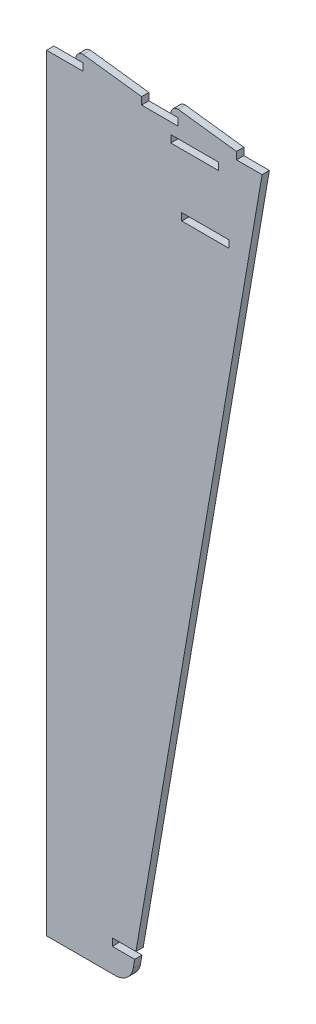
ISO-10303-21;
HEADER;
FILE_DESCRIPTION(('STEP AP214'),'2;1');
FILE_NAME('part.step','',(''),(''),'','','');
FILE_SCHEMA(('AUTOMOTIVE_DESIGN { 1 0 10303 214 1 1 1 1 }'));
ENDSEC;
DATA;
#1=APPLICATION_CONTEXT('core data for automotive mechanical design processes');
#2=APPLICATION_PROTOCOL_DEFINITION('international standard','automotive_design',2000,#1);
#3=PRODUCT_CONTEXT('',#1,'mechanical');
#4=PRODUCT('Part','Part','',(#3));
#5=PRODUCT_RELATED_PRODUCT_CATEGORY('part','',(#4));
#6=PRODUCT_DEFINITION_FORMATION('','',#4);
#7=PRODUCT_DEFINITION_CONTEXT('part definition',#1,'design');
#8=PRODUCT_DEFINITION('design','',#6,#7);
#9=PRODUCT_DEFINITION_SHAPE('','',#8);
#10=(LENGTH_UNIT() NAMED_UNIT(*) SI_UNIT(.MILLI.,.METRE.));
#11=(NAMED_UNIT(*) PLANE_ANGLE_UNIT() SI_UNIT($,.RADIAN.));
#12=(NAMED_UNIT(*) SI_UNIT($,.STERADIAN.) SOLID_ANGLE_UNIT());
#13=UNCERTAINTY_MEASURE_WITH_UNIT(LENGTH_MEASURE(1.E-05),#10,'distance_accuracy_value','');
#14=(GEOMETRIC_REPRESENTATION_CONTEXT(3) GLOBAL_UNCERTAINTY_ASSIGNED_CONTEXT((#13)) GLOBAL_UNIT_ASSIGNED_CONTEXT((#10,
#11,#12)) REPRESENTATION_CONTEXT('',''));
#15=CARTESIAN_POINT('',(0.,0.,0.));
#16=DIRECTION('',(0.,0.,1.));
#17=DIRECTION('',(1.,0.,0.));
#18=AXIS2_PLACEMENT_3D('',#15,#16,#17);
#19=CARTESIAN_POINT('',(2.49999999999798,-16.2500000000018,2.));
#20=DIRECTION('',(0.,0.,1.));
#21=DIRECTION('',(1.,0.,0.));
#22=AXIS2_PLACEMENT_3D('',#19,#20,#21);
#23=PLANE('',#22);
#24=DIRECTION('',(0.,-1.,0.));
#25=VECTOR('',#24,1.);
#26=CARTESIAN_POINT('',(-33.5000000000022,-18.2500000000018,2.));
#27=LINE('',#26,#25);
#28=CARTESIAN_POINT('',(-33.5000000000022,-18.2500000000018,2.));
#29=VERTEX_POINT('',#28);
#30=CARTESIAN_POINT('',(-33.5000000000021,-228.250000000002,2.));
#31=VERTEX_POINT('',#30);
#32=EDGE_CURVE('E335',#29,#31,#27,.T.);
#33=ORIENTED_EDGE('',*,*,#32,.T.);
#34=DIRECTION('',(1.,0.,0.));
#35=VECTOR('',#34,1.);
#36=CARTESIAN_POINT('',(-33.5000000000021,-228.250000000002,2.));
#37=LINE('',#36,#35);
#38=CARTESIAN_POINT('',(-14.7157945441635,-228.250000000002,2.));
#39=VERTEX_POINT('',#38);
#40=EDGE_CURVE('E337',#31,#39,#37,.T.);
#41=ORIENTED_EDGE('',*,*,#40,.T.);
#42=CARTESIAN_POINT('',(-14.7157945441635,-223.250000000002,2.));
#43=DIRECTION('',(0.,0.,1.));
#44=DIRECTION('',(1.,0.,0.));
#45=AXIS2_PLACEMENT_3D('',#42,#43,#44);
#46=CIRCLE('',#45,5.);
#47=CARTESIAN_POINT('',(-9.78768327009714,-224.094819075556,2.));
#48=VERTEX_POINT('',#47);
#49=EDGE_CURVE('E426',#39,#48,#46,.T.);
#50=ORIENTED_EDGE('',*,*,#49,.T.);
#51=DIRECTION('',(0.168963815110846,0.985622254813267,0.));
#52=VECTOR('',#51,1.);
#53=CARTESIAN_POINT('',(-10.5000000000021,-228.250000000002,2.));
#54=LINE('',#53,#52);
#55=CARTESIAN_POINT('',(-9.38228167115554,-221.729976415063,2.));
#56=VERTEX_POINT('',#55);
#57=EDGE_CURVE('E305',#48,#56,#54,.T.);
#58=ORIENTED_EDGE('',*,*,#57,.T.);
#59=DIRECTION('',(-1.,0.,0.));
#60=VECTOR('',#59,1.);
#61=CARTESIAN_POINT('',(2.49999999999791,-221.729976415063,2.));
#62=LINE('',#61,#60);
#63=CARTESIAN_POINT('',(-15.5000000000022,-221.729976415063,2.00000000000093));
#64=VERTEX_POINT('',#63);
#65=EDGE_CURVE('E301',#56,#64,#62,.T.);
#66=ORIENTED_EDGE('',*,*,#65,.T.);
#67=DIRECTION('',(0.,1.,0.));
#68=VECTOR('',#67,1.);
#69=CARTESIAN_POINT('',(-15.5000000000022,-219.729976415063,2.00000000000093));
#70=LINE('',#69,#68);
#71=CARTESIAN_POINT('',(-15.5000000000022,-219.729976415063,2.00000000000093));
#72=VERTEX_POINT('',#71);
#73=EDGE_CURVE('E288',#64,#72,#70,.T.);
#74=ORIENTED_EDGE('',*,*,#73,.T.);
#75=DIRECTION('',(-1.,0.,0.));
#76=VECTOR('',#75,1.);
#77=CARTESIAN_POINT('',(2.49999999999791,-219.729976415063,2.));
#78=LINE('',#77,#76);
#79=CARTESIAN_POINT('',(-9.0394245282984,-219.729976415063,2.));
#80=VERTEX_POINT('',#79);
#81=EDGE_CURVE('E297',#80,#72,#78,.T.);
#82=ORIENTED_EDGE('',*,*,#81,.F.);
#83=CARTESIAN_POINT('',(25.499999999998,-18.2500000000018,2.));
#84=VERTEX_POINT('',#83);
#85=EDGE_CURVE('E309',#80,#84,#54,.T.);
#86=ORIENTED_EDGE('',*,*,#85,.T.);
#87=DIRECTION('',(-1.,0.,0.));
#88=VECTOR('',#87,1.);
#89=CARTESIAN_POINT('',(18.499999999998,-18.2500000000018,2.));
#90=LINE('',#89,#88);
#91=CARTESIAN_POINT('',(18.499999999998,-18.2500000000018,2.));
#92=VERTEX_POINT('',#91);
#93=EDGE_CURVE('E308',#84,#92,#90,.T.);
#94=ORIENTED_EDGE('',*,*,#93,.T.);
#95=DIRECTION('',(0.,1.,0.));
#96=VECTOR('',#95,1.);
#97=CARTESIAN_POINT('',(18.499999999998,-18.2500000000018,2.));
#98=LINE('',#97,#96);
#99=CARTESIAN_POINT('',(18.499999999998,-16.2500000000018,2.));
#100=VERTEX_POINT('',#99);
#101=EDGE_CURVE('E311',#92,#100,#98,.T.);
#102=ORIENTED_EDGE('',*,*,#101,.T.);
#103=DIRECTION('',(-0.992277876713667,0.124034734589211,0.));
#104=VECTOR('',#103,1.);
#105=CARTESIAN_POINT('',(2.49999999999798,-14.2500000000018,2.));
#106=LINE('',#105,#104);
#107=CARTESIAN_POINT('',(2.49999999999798,-14.2500000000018,2.));
#108=VERTEX_POINT('',#107);
#109=EDGE_CURVE('E313',#100,#108,#106,.T.);
#110=ORIENTED_EDGE('',*,*,#109,.T.);
#111=CARTESIAN_POINT('',(2.49999999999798,-16.2500000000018,2.));
#112=DIRECTION('',(0.,0.,1.));
#113=DIRECTION('',(1.,0.,0.));
#114=AXIS2_PLACEMENT_3D('',#111,#112,#113);
#115=CIRCLE('',#114,2.);
#116=CARTESIAN_POINT('',(0.499999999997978,-16.2500000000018,2.));
#117=VERTEX_POINT('',#116);
#118=EDGE_CURVE('E315',#108,#117,#115,.T.);
#119=ORIENTED_EDGE('',*,*,#118,.T.);
#120=DIRECTION('',(1.,0.,0.));
#121=VECTOR('',#120,1.);
#122=CARTESIAN_POINT('',(2.49999999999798,-16.2500000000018,2.));
#123=LINE('',#122,#121);
#124=CARTESIAN_POINT('',(2.49999999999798,-16.2500000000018,2.));
#125=VERTEX_POINT('',#124);
#126=EDGE_CURVE('E317',#117,#125,#123,.T.);
#127=ORIENTED_EDGE('',*,*,#126,.T.);
#128=DIRECTION('',(0.,-1.,0.));
#129=VECTOR('',#128,1.);
#130=CARTESIAN_POINT('',(2.49999999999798,-18.2500000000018,2.));
#131=LINE('',#130,#129);
#132=CARTESIAN_POINT('',(2.49999999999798,-18.2500000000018,2.));
#133=VERTEX_POINT('',#132);
#134=EDGE_CURVE('E319',#125,#133,#131,.T.);
#135=ORIENTED_EDGE('',*,*,#134,.T.);
#136=DIRECTION('',(-1.,0.,0.));
#137=VECTOR('',#136,1.);
#138=CARTESIAN_POINT('',(2.49999999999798,-18.2500000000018,2.));
#139=LINE('',#138,#137);
#140=CARTESIAN_POINT('',(-7.50000000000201,-18.2500000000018,2.));
#141=VERTEX_POINT('',#140);
#142=EDGE_CURVE('E321',#133,#141,#139,.T.);
#143=ORIENTED_EDGE('',*,*,#142,.T.);
#144=DIRECTION('',(0.,1.,0.));
#145=VECTOR('',#144,1.);
#146=CARTESIAN_POINT('',(-7.50000000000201,-18.2500000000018,2.));
#147=LINE('',#146,#145);
#148=CARTESIAN_POINT('',(-7.50000000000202,-16.2500000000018,2.));
#149=VERTEX_POINT('',#148);
#150=EDGE_CURVE('E323',#141,#149,#147,.T.);
#151=ORIENTED_EDGE('',*,*,#150,.T.);
#152=DIRECTION('',(-0.992277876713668,0.124034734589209,0.));
#153=VECTOR('',#152,1.);
#154=CARTESIAN_POINT('',(-23.500000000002,-14.2500000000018,2.));
#155=LINE('',#154,#153);
#156=CARTESIAN_POINT('',(-23.500000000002,-14.2500000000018,2.));
#157=VERTEX_POINT('',#156);
#158=EDGE_CURVE('E325',#149,#157,#155,.T.);
#159=ORIENTED_EDGE('',*,*,#158,.T.);
#160=CARTESIAN_POINT('',(-23.500000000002,-16.2500000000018,2.));
#161=DIRECTION('',(0.,0.,1.));
#162=DIRECTION('',(1.,0.,0.));
#163=AXIS2_PLACEMENT_3D('',#160,#161,#162);
#164=CIRCLE('',#163,2.);
#165=CARTESIAN_POINT('',(-25.500000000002,-16.2500000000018,2.));
#166=VERTEX_POINT('',#165);
#167=EDGE_CURVE('E327',#157,#166,#164,.T.);
#168=ORIENTED_EDGE('',*,*,#167,.T.);
#169=DIRECTION('',(1.,0.,0.));
#170=VECTOR('',#169,1.);
#171=CARTESIAN_POINT('',(-23.500000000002,-16.2500000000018,2.));
#172=LINE('',#171,#170);
#173=CARTESIAN_POINT('',(-23.500000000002,-16.2500000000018,2.));
#174=VERTEX_POINT('',#173);
#175=EDGE_CURVE('E329',#166,#174,#172,.T.);
#176=ORIENTED_EDGE('',*,*,#175,.T.);
#177=DIRECTION('',(0.,-1.,0.));
#178=VECTOR('',#177,1.);
#179=CARTESIAN_POINT('',(-23.500000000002,-18.2500000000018,2.));
#180=LINE('',#179,#178);
#181=CARTESIAN_POINT('',(-23.500000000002,-18.2500000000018,2.));
#182=VERTEX_POINT('',#181);
#183=EDGE_CURVE('E331',#174,#182,#180,.T.);
#184=ORIENTED_EDGE('',*,*,#183,.T.);
#185=DIRECTION('',(-1.,0.,0.));
#186=VECTOR('',#185,1.);
#187=CARTESIAN_POINT('',(-23.500000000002,-18.2500000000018,2.));
#188=LINE('',#187,#186);
#189=EDGE_CURVE('E333',#182,#29,#188,.T.);
#190=ORIENTED_EDGE('',*,*,#189,.T.);
#191=EDGE_LOOP('',(#33,#41,#50,#58,#66,#74,#82,#86,#94,#102,#110,#119,#127,#135,#143,#151,#159,
#168,#176,#184,#190));
#192=FACE_BOUND('',#191,.T.);
#193=DIRECTION('',(-1.,0.,0.));
#194=VECTOR('',#193,1.);
#195=CARTESIAN_POINT('',(13.4999999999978,-21.2500000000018,2.));
#196=LINE('',#195,#194);
#197=CARTESIAN_POINT('',(13.4999999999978,-21.2500000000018,2.));
#198=VERTEX_POINT('',#197);
#199=CARTESIAN_POINT('',(0.499999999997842,-21.2500000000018,2.));
#200=VERTEX_POINT('',#199);
#201=EDGE_CURVE('E263',#198,#200,#196,.T.);
#202=ORIENTED_EDGE('',*,*,#201,.F.);
#203=DIRECTION('',(0.,1.,0.));
#204=VECTOR('',#203,1.);
#205=CARTESIAN_POINT('',(13.4999999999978,-23.2500000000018,2.));
#206=LINE('',#205,#204);
#207=CARTESIAN_POINT('',(13.4999999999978,-23.2500000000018,2.));
#208=VERTEX_POINT('',#207);
#209=EDGE_CURVE('E261',#208,#198,#206,.T.);
#210=ORIENTED_EDGE('',*,*,#209,.F.);
#211=DIRECTION('',(1.,0.,0.));
#212=VECTOR('',#211,1.);
#213=CARTESIAN_POINT('',(13.4999999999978,-23.2500000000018,2.));
#214=LINE('',#213,#212);
#215=CARTESIAN_POINT('',(0.499999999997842,-23.2500000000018,2.));
#216=VERTEX_POINT('',#215);
#217=EDGE_CURVE('E268',#216,#208,#214,.T.);
#218=ORIENTED_EDGE('',*,*,#217,.F.);
#219=DIRECTION('',(0.,-1.,0.));
#220=VECTOR('',#219,1.);
#221=CARTESIAN_POINT('',(0.499999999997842,-23.2500000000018,2.));
#222=LINE('',#221,#220);
#223=EDGE_CURVE('E266',#200,#216,#222,.T.);
#224=ORIENTED_EDGE('',*,*,#223,.F.);
#225=EDGE_LOOP('',(#202,#210,#218,#224));
#226=FACE_BOUND('',#225,.T.);
#227=DIRECTION('',(1.,0.,0.));
#228=VECTOR('',#227,1.);
#229=CARTESIAN_POINT('',(3.49999999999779,-40.2500000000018,2.00000000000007));
#230=LINE('',#229,#228);
#231=CARTESIAN_POINT('',(3.49999999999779,-40.2500000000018,2.00000000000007));
#232=VERTEX_POINT('',#231);
#233=CARTESIAN_POINT('',(16.4999999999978,-40.2500000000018,2.));
#234=VERTEX_POINT('',#233);
#235=EDGE_CURVE('E237',#232,#234,#230,.T.);
#236=ORIENTED_EDGE('',*,*,#235,.F.);
#237=DIRECTION('',(0.,-1.,0.));
#238=VECTOR('',#237,1.);
#239=CARTESIAN_POINT('',(3.49999999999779,-38.2500000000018,2.00000000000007));
#240=LINE('',#239,#238);
#241=CARTESIAN_POINT('',(3.49999999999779,-38.2500000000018,2.00000000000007));
#242=VERTEX_POINT('',#241);
#243=EDGE_CURVE('E227',#242,#232,#240,.T.);
#244=ORIENTED_EDGE('',*,*,#243,.F.);
#245=DIRECTION('',(-1.,0.,0.));
#246=VECTOR('',#245,1.);
#247=CARTESIAN_POINT('',(3.49999999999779,-38.2500000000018,2.00000000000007));
#248=LINE('',#247,#246);
#249=CARTESIAN_POINT('',(16.4999999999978,-38.2500000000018,2.00000000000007));
#250=VERTEX_POINT('',#249);
#251=EDGE_CURVE('E248',#250,#242,#248,.T.);
#252=ORIENTED_EDGE('',*,*,#251,.F.);
#253=DIRECTION('',(0.,1.,0.));
#254=VECTOR('',#253,1.);
#255=CARTESIAN_POINT('',(16.4999999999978,-38.2500000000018,2.00000000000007));
#256=LINE('',#255,#254);
#257=EDGE_CURVE('E246',#234,#250,#256,.T.);
#258=ORIENTED_EDGE('',*,*,#257,.F.);
#259=EDGE_LOOP('',(#236,#244,#252,#258));
#260=FACE_BOUND('',#259,.T.);
#261=ADVANCED_FACE('F35',(#192,#226,#260),#23,.T.);
#262=CARTESIAN_POINT('',(-10.5000000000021,-228.250000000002,2.));
#263=DIRECTION('',(-0.985622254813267,0.168963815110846,0.));
#264=DIRECTION('',(-0.168963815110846,-0.985622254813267,0.));
#265=AXIS2_PLACEMENT_3D('',#262,#263,#264);
#266=PLANE('',#265);
#267=DIRECTION('',(0.,0.,-1.));
#268=VECTOR('',#267,1.);
#269=CARTESIAN_POINT('',(-9.38228167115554,-221.729976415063,2.));
#270=LINE('',#269,#268);
#271=CARTESIAN_POINT('',(-9.38228167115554,-221.729976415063,0.));
#272=VERTEX_POINT('',#271);
#273=EDGE_CURVE('E299',#56,#272,#270,.T.);
#274=ORIENTED_EDGE('',*,*,#273,.F.);
#275=ORIENTED_EDGE('',*,*,#57,.F.);
#276=DIRECTION('',(0.,0.,-1.));
#277=VECTOR('',#276,1.);
#278=CARTESIAN_POINT('',(-9.78768327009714,-224.094819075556,2.));
#279=LINE('',#278,#277);
#280=CARTESIAN_POINT('',(-9.78768327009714,-224.094819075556,0.));
#281=VERTEX_POINT('',#280);
#282=EDGE_CURVE('E419',#48,#281,#279,.T.);
#283=ORIENTED_EDGE('',*,*,#282,.T.);
#284=DIRECTION('',(0.168963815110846,0.985622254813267,0.));
#285=VECTOR('',#284,1.);
#286=CARTESIAN_POINT('',(-10.5000000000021,-228.250000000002,0.));
#287=LINE('',#286,#285);
#288=EDGE_CURVE('E341',#281,#272,#287,.T.);
#289=ORIENTED_EDGE('',*,*,#288,.T.);
#290=EDGE_LOOP('',(#274,#275,#283,#289));
#291=FACE_BOUND('',#290,.T.);
#292=ADVANCED_FACE('F468',(#291),#266,.F.);
#293=ORIENTED_EDGE('',*,*,#85,.F.);
#294=DIRECTION('',(0.,0.,-1.));
#295=VECTOR('',#294,1.);
#296=CARTESIAN_POINT('',(-9.0394245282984,-219.729976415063,2.));
#297=LINE('',#296,#295);
#298=CARTESIAN_POINT('',(-9.0394245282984,-219.729976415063,0.));
#299=VERTEX_POINT('',#298);
#300=EDGE_CURVE('E294',#80,#299,#297,.T.);
#301=ORIENTED_EDGE('',*,*,#300,.T.);
#302=CARTESIAN_POINT('',(25.499999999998,-18.2500000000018,0.));
#303=VERTEX_POINT('',#302);
#304=EDGE_CURVE('E304',#299,#303,#287,.T.);
#305=ORIENTED_EDGE('',*,*,#304,.T.);
#306=DIRECTION('',(0.,0.,-1.));
#307=VECTOR('',#306,1.);
#308=CARTESIAN_POINT('',(25.499999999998,-18.2500000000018,2.));
#309=LINE('',#308,#307);
#310=EDGE_CURVE('E416',#84,#303,#309,.T.);
#311=ORIENTED_EDGE('',*,*,#310,.F.);
#312=EDGE_LOOP('',(#293,#301,#305,#311));
#313=FACE_BOUND('',#312,.T.);
#314=ADVANCED_FACE('F474',(#313),#266,.F.);
#315=CARTESIAN_POINT('',(18.499999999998,-18.2500000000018,2.));
#316=DIRECTION('',(0.,-1.,0.));
#317=DIRECTION('',(0.,0.,-1.));
#318=AXIS2_PLACEMENT_3D('',#315,#316,#317);
#319=PLANE('',#318);
#320=DIRECTION('',(-1.,0.,0.));
#321=VECTOR('',#320,1.);
#322=CARTESIAN_POINT('',(18.499999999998,-18.2500000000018,0.));
#323=LINE('',#322,#321);
#324=CARTESIAN_POINT('',(18.499999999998,-18.2500000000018,0.));
#325=VERTEX_POINT('',#324);
#326=EDGE_CURVE('E344',#303,#325,#323,.T.);
#327=ORIENTED_EDGE('',*,*,#326,.T.);
#328=DIRECTION('',(0.,0.,-1.));
#329=VECTOR('',#328,1.);
#330=CARTESIAN_POINT('',(18.499999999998,-18.2500000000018,2.));
#331=LINE('',#330,#329);
#332=EDGE_CURVE('E413',#92,#325,#331,.T.);
#333=ORIENTED_EDGE('',*,*,#332,.F.);
#334=ORIENTED_EDGE('',*,*,#93,.F.);
#335=ORIENTED_EDGE('',*,*,#310,.T.);
#336=EDGE_LOOP('',(#327,#333,#334,#335));
#337=FACE_BOUND('',#336,.T.);
#338=ADVANCED_FACE('F538',(#337),#319,.F.);
#339=CARTESIAN_POINT('',(18.499999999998,-18.2500000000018,2.));
#340=DIRECTION('',(-1.,0.,0.));
#341=DIRECTION('',(0.,0.,1.));
#342=AXIS2_PLACEMENT_3D('',#339,#340,#341);
#343=PLANE('',#342);
#344=DIRECTION('',(0.,1.,0.));
#345=VECTOR('',#344,1.);
#346=CARTESIAN_POINT('',(18.499999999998,-18.2500000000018,0.));
#347=LINE('',#346,#345);
#348=CARTESIAN_POINT('',(18.499999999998,-16.2500000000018,0.));
#349=VERTEX_POINT('',#348);
#350=EDGE_CURVE('E346',#325,#349,#347,.T.);
#351=ORIENTED_EDGE('',*,*,#350,.T.);
#352=DIRECTION('',(0.,0.,-1.));
#353=VECTOR('',#352,1.);
#354=CARTESIAN_POINT('',(18.499999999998,-16.2500000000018,2.));
#355=LINE('',#354,#353);
#356=EDGE_CURVE('E410',#100,#349,#355,.T.);
#357=ORIENTED_EDGE('',*,*,#356,.F.);
#358=ORIENTED_EDGE('',*,*,#101,.F.);
#359=ORIENTED_EDGE('',*,*,#332,.T.);
#360=EDGE_LOOP('',(#351,#357,#358,#359));
#361=FACE_BOUND('',#360,.T.);
#362=ADVANCED_FACE('F534',(#361),#343,.F.);
#363=CARTESIAN_POINT('',(2.49999999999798,-14.2500000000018,2.));
#364=DIRECTION('',(-0.124034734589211,-0.992277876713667,0.));
#365=DIRECTION('',(0.992277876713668,-0.124034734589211,0.));
#366=AXIS2_PLACEMENT_3D('',#363,#364,#365);
#367=PLANE('',#366);
#368=DIRECTION('',(-0.992277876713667,0.124034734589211,0.));
#369=VECTOR('',#368,1.);
#370=CARTESIAN_POINT('',(2.49999999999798,-14.2500000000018,0.));
#371=LINE('',#370,#369);
#372=CARTESIAN_POINT('',(2.49999999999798,-14.2500000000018,0.));
#373=VERTEX_POINT('',#372);
#374=EDGE_CURVE('E348',#349,#373,#371,.T.);
#375=ORIENTED_EDGE('',*,*,#374,.T.);
#376=DIRECTION('',(0.,0.,-1.));
#377=VECTOR('',#376,1.);
#378=CARTESIAN_POINT('',(2.49999999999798,-14.2500000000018,2.));
#379=LINE('',#378,#377);
#380=EDGE_CURVE('E407',#108,#373,#379,.T.);
#381=ORIENTED_EDGE('',*,*,#380,.F.);
#382=ORIENTED_EDGE('',*,*,#109,.F.);
#383=ORIENTED_EDGE('',*,*,#356,.T.);
#384=EDGE_LOOP('',(#375,#381,#382,#383));
#385=FACE_BOUND('',#384,.T.);
#386=ADVANCED_FACE('F530',(#385),#367,.F.);
#387=CARTESIAN_POINT('',(2.49999999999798,-16.2500000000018,2.));
#388=DIRECTION('',(0.,0.,-1.));
#389=DIRECTION('',(-1.,0.,0.));
#390=AXIS2_PLACEMENT_3D('',#387,#388,#389);
#391=CYLINDRICAL_SURFACE('',#390,2.);
#392=CARTESIAN_POINT('',(2.49999999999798,-16.2500000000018,0.));
#393=DIRECTION('',(0.,0.,1.));
#394=DIRECTION('',(1.,0.,0.));
#395=AXIS2_PLACEMENT_3D('',#392,#393,#394);
#396=CIRCLE('',#395,2.);
#397=CARTESIAN_POINT('',(0.499999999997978,-16.2500000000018,0.));
#398=VERTEX_POINT('',#397);
#399=EDGE_CURVE('E350',#373,#398,#396,.T.);
#400=ORIENTED_EDGE('',*,*,#399,.T.);
#401=DIRECTION('',(0.,0.,-1.));
#402=VECTOR('',#401,1.);
#403=CARTESIAN_POINT('',(0.499999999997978,-16.2500000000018,2.));
#404=LINE('',#403,#402);
#405=EDGE_CURVE('E404',#117,#398,#404,.T.);
#406=ORIENTED_EDGE('',*,*,#405,.F.);
#407=ORIENTED_EDGE('',*,*,#118,.F.);
#408=ORIENTED_EDGE('',*,*,#380,.T.);
#409=EDGE_LOOP('',(#400,#406,#407,#408));
#410=FACE_BOUND('',#409,.T.);
#411=ADVANCED_FACE('F526',(#410),#391,.T.);
#412=CARTESIAN_POINT('',(2.49999999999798,-16.2500000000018,2.));
#413=DIRECTION('',(0.,1.,0.));
#414=DIRECTION('',(-1.,0.,0.));
#415=AXIS2_PLACEMENT_3D('',#412,#413,#414);
#416=PLANE('',#415);
#417=DIRECTION('',(1.,0.,0.));
#418=VECTOR('',#417,1.);
#419=CARTESIAN_POINT('',(2.49999999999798,-16.2500000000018,0.));
#420=LINE('',#419,#418);
#421=CARTESIAN_POINT('',(2.49999999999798,-16.2500000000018,0.));
#422=VERTEX_POINT('',#421);
#423=EDGE_CURVE('E352',#398,#422,#420,.T.);
#424=ORIENTED_EDGE('',*,*,#423,.T.);
#425=DIRECTION('',(0.,0.,-1.));
#426=VECTOR('',#425,1.);
#427=CARTESIAN_POINT('',(2.49999999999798,-16.2500000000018,2.));
#428=LINE('',#427,#426);
#429=EDGE_CURVE('E401',#125,#422,#428,.T.);
#430=ORIENTED_EDGE('',*,*,#429,.F.);
#431=ORIENTED_EDGE('',*,*,#126,.F.);
#432=ORIENTED_EDGE('',*,*,#405,.T.);
#433=EDGE_LOOP('',(#424,#430,#431,#432));
#434=FACE_BOUND('',#433,.T.);
#435=ADVANCED_FACE('F522',(#434),#416,.F.);
#436=CARTESIAN_POINT('',(2.49999999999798,-18.2500000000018,2.));
#437=DIRECTION('',(1.,0.,0.));
#438=DIRECTION('',(0.,1.,0.));
#439=AXIS2_PLACEMENT_3D('',#436,#437,#438);
#440=PLANE('',#439);
#441=DIRECTION('',(0.,-1.,0.));
#442=VECTOR('',#441,1.);
#443=CARTESIAN_POINT('',(2.49999999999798,-18.2500000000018,0.));
#444=LINE('',#443,#442);
#445=CARTESIAN_POINT('',(2.49999999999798,-18.2500000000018,0.));
#446=VERTEX_POINT('',#445);
#447=EDGE_CURVE('E354',#422,#446,#444,.T.);
#448=ORIENTED_EDGE('',*,*,#447,.T.);
#449=DIRECTION('',(0.,0.,-1.));
#450=VECTOR('',#449,1.);
#451=CARTESIAN_POINT('',(2.49999999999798,-18.2500000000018,2.));
#452=LINE('',#451,#450);
#453=EDGE_CURVE('E398',#133,#446,#452,.T.);
#454=ORIENTED_EDGE('',*,*,#453,.F.);
#455=ORIENTED_EDGE('',*,*,#134,.F.);
#456=ORIENTED_EDGE('',*,*,#429,.T.);
#457=EDGE_LOOP('',(#448,#454,#455,#456));
#458=FACE_BOUND('',#457,.T.);
#459=ADVANCED_FACE('F518',(#458),#440,.F.);
#460=CARTESIAN_POINT('',(2.49999999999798,-18.2500000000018,2.));
#461=DIRECTION('',(0.,-1.,0.));
#462=DIRECTION('',(0.,0.,-1.));
#463=AXIS2_PLACEMENT_3D('',#460,#461,#462);
#464=PLANE('',#463);
#465=DIRECTION('',(-1.,0.,0.));
#466=VECTOR('',#465,1.);
#467=CARTESIAN_POINT('',(2.49999999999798,-18.2500000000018,0.));
#468=LINE('',#467,#466);
#469=CARTESIAN_POINT('',(-7.50000000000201,-18.2500000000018,0.));
#470=VERTEX_POINT('',#469);
#471=EDGE_CURVE('E356',#446,#470,#468,.T.);
#472=ORIENTED_EDGE('',*,*,#471,.T.);
#473=DIRECTION('',(0.,0.,-1.));
#474=VECTOR('',#473,1.);
#475=CARTESIAN_POINT('',(-7.50000000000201,-18.2500000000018,2.));
#476=LINE('',#475,#474);
#477=EDGE_CURVE('E395',#141,#470,#476,.T.);
#478=ORIENTED_EDGE('',*,*,#477,.F.);
#479=ORIENTED_EDGE('',*,*,#142,.F.);
#480=ORIENTED_EDGE('',*,*,#453,.T.);
#481=EDGE_LOOP('',(#472,#478,#479,#480));
#482=FACE_BOUND('',#481,.T.);
#483=ADVANCED_FACE('F514',(#482),#464,.F.);
#484=CARTESIAN_POINT('',(-7.50000000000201,-18.2500000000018,2.));
#485=DIRECTION('',(-1.,0.,0.));
#486=DIRECTION('',(0.,-1.,0.));
#487=AXIS2_PLACEMENT_3D('',#484,#485,#486);
#488=PLANE('',#487);
#489=DIRECTION('',(0.,1.,0.));
#490=VECTOR('',#489,1.);
#491=CARTESIAN_POINT('',(-7.50000000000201,-18.2500000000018,0.));
#492=LINE('',#491,#490);
#493=CARTESIAN_POINT('',(-7.50000000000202,-16.2500000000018,0.));
#494=VERTEX_POINT('',#493);
#495=EDGE_CURVE('E358',#470,#494,#492,.T.);
#496=ORIENTED_EDGE('',*,*,#495,.T.);
#497=DIRECTION('',(0.,0.,-1.));
#498=VECTOR('',#497,1.);
#499=CARTESIAN_POINT('',(-7.50000000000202,-16.2500000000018,2.));
#500=LINE('',#499,#498);
#501=EDGE_CURVE('E392',#149,#494,#500,.T.);
#502=ORIENTED_EDGE('',*,*,#501,.F.);
#503=ORIENTED_EDGE('',*,*,#150,.F.);
#504=ORIENTED_EDGE('',*,*,#477,.T.);
#505=EDGE_LOOP('',(#496,#502,#503,#504));
#506=FACE_BOUND('',#505,.T.);
#507=ADVANCED_FACE('F510',(#506),#488,.F.);
#508=CARTESIAN_POINT('',(-23.500000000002,-14.2500000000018,2.));
#509=DIRECTION('',(-0.124034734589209,-0.992277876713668,0.));
#510=DIRECTION('',(0.992277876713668,-0.124034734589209,0.));
#511=AXIS2_PLACEMENT_3D('',#508,#509,#510);
#512=PLANE('',#511);
#513=DIRECTION('',(-0.992277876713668,0.124034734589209,0.));
#514=VECTOR('',#513,1.);
#515=CARTESIAN_POINT('',(-23.500000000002,-14.2500000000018,0.));
#516=LINE('',#515,#514);
#517=CARTESIAN_POINT('',(-23.500000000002,-14.2500000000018,0.));
#518=VERTEX_POINT('',#517);
#519=EDGE_CURVE('E360',#494,#518,#516,.T.);
#520=ORIENTED_EDGE('',*,*,#519,.T.);
#521=DIRECTION('',(0.,0.,-1.));
#522=VECTOR('',#521,1.);
#523=CARTESIAN_POINT('',(-23.500000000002,-14.2500000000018,2.));
#524=LINE('',#523,#522);
#525=EDGE_CURVE('E389',#157,#518,#524,.T.);
#526=ORIENTED_EDGE('',*,*,#525,.F.);
#527=ORIENTED_EDGE('',*,*,#158,.F.);
#528=ORIENTED_EDGE('',*,*,#501,.T.);
#529=EDGE_LOOP('',(#520,#526,#527,#528));
#530=FACE_BOUND('',#529,.T.);
#531=ADVANCED_FACE('F506',(#530),#512,.F.);
#532=CARTESIAN_POINT('',(-23.500000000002,-16.2500000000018,2.));
#533=DIRECTION('',(0.,0.,-1.));
#534=DIRECTION('',(-1.,0.,0.));
#535=AXIS2_PLACEMENT_3D('',#532,#533,#534);
#536=CYLINDRICAL_SURFACE('',#535,2.);
#537=CARTESIAN_POINT('',(-23.500000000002,-16.2500000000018,0.));
#538=DIRECTION('',(0.,0.,1.));
#539=DIRECTION('',(1.,0.,0.));
#540=AXIS2_PLACEMENT_3D('',#537,#538,#539);
#541=CIRCLE('',#540,2.);
#542=CARTESIAN_POINT('',(-25.500000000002,-16.2500000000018,0.));
#543=VERTEX_POINT('',#542);
#544=EDGE_CURVE('E362',#518,#543,#541,.T.);
#545=ORIENTED_EDGE('',*,*,#544,.T.);
#546=DIRECTION('',(0.,0.,-1.));
#547=VECTOR('',#546,1.);
#548=CARTESIAN_POINT('',(-25.500000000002,-16.2500000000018,2.));
#549=LINE('',#548,#547);
#550=EDGE_CURVE('E386',#166,#543,#549,.T.);
#551=ORIENTED_EDGE('',*,*,#550,.F.);
#552=ORIENTED_EDGE('',*,*,#167,.F.);
#553=ORIENTED_EDGE('',*,*,#525,.T.);
#554=EDGE_LOOP('',(#545,#551,#552,#553));
#555=FACE_BOUND('',#554,.T.);
#556=ADVANCED_FACE('F502',(#555),#536,.T.);
#557=CARTESIAN_POINT('',(-23.500000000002,-16.2500000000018,2.));
#558=DIRECTION('',(0.,1.,0.));
#559=DIRECTION('',(0.,0.,1.));
#560=AXIS2_PLACEMENT_3D('',#557,#558,#559);
#561=PLANE('',#560);
#562=DIRECTION('',(1.,0.,0.));
#563=VECTOR('',#562,1.);
#564=CARTESIAN_POINT('',(-23.500000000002,-16.2500000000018,0.));
#565=LINE('',#564,#563);
#566=CARTESIAN_POINT('',(-23.500000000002,-16.2500000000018,0.));
#567=VERTEX_POINT('',#566);
#568=EDGE_CURVE('E364',#543,#567,#565,.T.);
#569=ORIENTED_EDGE('',*,*,#568,.T.);
#570=DIRECTION('',(0.,0.,-1.));
#571=VECTOR('',#570,1.);
#572=CARTESIAN_POINT('',(-23.500000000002,-16.2500000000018,2.));
#573=LINE('',#572,#571);
#574=EDGE_CURVE('E383',#174,#567,#573,.T.);
#575=ORIENTED_EDGE('',*,*,#574,.F.);
#576=ORIENTED_EDGE('',*,*,#175,.F.);
#577=ORIENTED_EDGE('',*,*,#550,.T.);
#578=EDGE_LOOP('',(#569,#575,#576,#577));
#579=FACE_BOUND('',#578,.T.);
#580=ADVANCED_FACE('F498',(#579),#561,.F.);
#581=CARTESIAN_POINT('',(-23.500000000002,-18.2500000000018,2.));
#582=DIRECTION('',(1.,0.,0.));
#583=DIRECTION('',(0.,0.,-1.));
#584=AXIS2_PLACEMENT_3D('',#581,#582,#583);
#585=PLANE('',#584);
#586=DIRECTION('',(0.,-1.,0.));
#587=VECTOR('',#586,1.);
#588=CARTESIAN_POINT('',(-23.500000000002,-18.2500000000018,0.));
#589=LINE('',#588,#587);
#590=CARTESIAN_POINT('',(-23.500000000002,-18.2500000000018,0.));
#591=VERTEX_POINT('',#590);
#592=EDGE_CURVE('E366',#567,#591,#589,.T.);
#593=ORIENTED_EDGE('',*,*,#592,.T.);
#594=DIRECTION('',(0.,0.,-1.));
#595=VECTOR('',#594,1.);
#596=CARTESIAN_POINT('',(-23.500000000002,-18.2500000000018,2.));
#597=LINE('',#596,#595);
#598=EDGE_CURVE('E380',#182,#591,#597,.T.);
#599=ORIENTED_EDGE('',*,*,#598,.F.);
#600=ORIENTED_EDGE('',*,*,#183,.F.);
#601=ORIENTED_EDGE('',*,*,#574,.T.);
#602=EDGE_LOOP('',(#593,#599,#600,#601));
#603=FACE_BOUND('',#602,.T.);
#604=ADVANCED_FACE('F494',(#603),#585,.F.);
#605=CARTESIAN_POINT('',(-23.500000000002,-18.2500000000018,2.));
#606=DIRECTION('',(0.,-1.,0.));
#607=DIRECTION('',(0.,0.,-1.));
#608=AXIS2_PLACEMENT_3D('',#605,#606,#607);
#609=PLANE('',#608);
#610=DIRECTION('',(-1.,0.,0.));
#611=VECTOR('',#610,1.);
#612=CARTESIAN_POINT('',(-23.500000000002,-18.2500000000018,0.));
#613=LINE('',#612,#611);
#614=CARTESIAN_POINT('',(-33.5000000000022,-18.2500000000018,0.));
#615=VERTEX_POINT('',#614);
#616=EDGE_CURVE('E368',#591,#615,#613,.T.);
#617=ORIENTED_EDGE('',*,*,#616,.T.);
#618=DIRECTION('',(0.,0.,-1.));
#619=VECTOR('',#618,1.);
#620=CARTESIAN_POINT('',(-33.5000000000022,-18.2500000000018,2.));
#621=LINE('',#620,#619);
#622=EDGE_CURVE('E377',#29,#615,#621,.T.);
#623=ORIENTED_EDGE('',*,*,#622,.F.);
#624=ORIENTED_EDGE('',*,*,#189,.F.);
#625=ORIENTED_EDGE('',*,*,#598,.T.);
#626=EDGE_LOOP('',(#617,#623,#624,#625));
#627=FACE_BOUND('',#626,.T.);
#628=ADVANCED_FACE('F490',(#627),#609,.F.);
#629=CARTESIAN_POINT('',(-33.5000000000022,-18.2500000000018,2.));
#630=DIRECTION('',(1.,0.,0.));
#631=DIRECTION('',(0.,1.,0.));
#632=AXIS2_PLACEMENT_3D('',#629,#630,#631);
#633=PLANE('',#632);
#634=DIRECTION('',(0.,-1.,0.));
#635=VECTOR('',#634,1.);
#636=CARTESIAN_POINT('',(-33.5000000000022,-18.2500000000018,0.));
#637=LINE('',#636,#635);
#638=CARTESIAN_POINT('',(-33.5000000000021,-228.250000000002,0.));
#639=VERTEX_POINT('',#638);
#640=EDGE_CURVE('E370',#615,#639,#637,.T.);
#641=ORIENTED_EDGE('',*,*,#640,.T.);
#642=DIRECTION('',(0.,0.,-1.));
#643=VECTOR('',#642,1.);
#644=CARTESIAN_POINT('',(-33.5000000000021,-228.250000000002,2.));
#645=LINE('',#644,#643);
#646=EDGE_CURVE('E340',#31,#639,#645,.T.);
#647=ORIENTED_EDGE('',*,*,#646,.F.);
#648=ORIENTED_EDGE('',*,*,#32,.F.);
#649=ORIENTED_EDGE('',*,*,#622,.T.);
#650=EDGE_LOOP('',(#641,#647,#648,#649));
#651=FACE_BOUND('',#650,.T.);
#652=ADVANCED_FACE('F486',(#651),#633,.F.);
#653=CARTESIAN_POINT('',(-33.5000000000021,-228.250000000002,2.));
#654=DIRECTION('',(0.,1.,0.));
#655=DIRECTION('',(0.,0.,1.));
#656=AXIS2_PLACEMENT_3D('',#653,#654,#655);
#657=PLANE('',#656);
#658=DIRECTION('',(1.,0.,0.));
#659=VECTOR('',#658,1.);
#660=CARTESIAN_POINT('',(-33.5000000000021,-228.250000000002,0.));
#661=LINE('',#660,#659);
#662=CARTESIAN_POINT('',(-14.7157945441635,-228.250000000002,0.));
#663=VERTEX_POINT('',#662);
#664=EDGE_CURVE('E372',#639,#663,#661,.T.);
#665=ORIENTED_EDGE('',*,*,#664,.T.);
#666=DIRECTION('',(0.,0.,-1.));
#667=VECTOR('',#666,1.);
#668=CARTESIAN_POINT('',(-14.7157945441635,-228.250000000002,2.));
#669=LINE('',#668,#667);
#670=EDGE_CURVE('E424',#663,#39,#669,.F.);
#671=ORIENTED_EDGE('',*,*,#670,.T.);
#672=ORIENTED_EDGE('',*,*,#40,.F.);
#673=ORIENTED_EDGE('',*,*,#646,.T.);
#674=EDGE_LOOP('',(#665,#671,#672,#673));
#675=FACE_BOUND('',#674,.T.);
#676=ADVANCED_FACE('F482',(#675),#657,.F.);
#677=CARTESIAN_POINT('',(2.49999999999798,-16.2500000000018,0.));
#678=DIRECTION('',(0.,0.,1.));
#679=DIRECTION('',(1.,0.,0.));
#680=AXIS2_PLACEMENT_3D('',#677,#678,#679);
#681=PLANE('',#680);
#682=DIRECTION('',(1.,0.,0.));
#683=VECTOR('',#682,1.);
#684=CARTESIAN_POINT('',(2.49999999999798,-38.2500000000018,0.));
#685=LINE('',#684,#683);
#686=CARTESIAN_POINT('',(3.49999999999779,-38.2500000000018,0.));
#687=VERTEX_POINT('',#686);
#688=CARTESIAN_POINT('',(16.4999999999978,-38.2500000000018,0.));
#689=VERTEX_POINT('',#688);
#690=EDGE_CURVE('E11',#687,#689,#685,.T.);
#691=ORIENTED_EDGE('',*,*,#690,.F.);
#692=DIRECTION('',(0.,-1.,0.));
#693=VECTOR('',#692,1.);
#694=CARTESIAN_POINT('',(3.49999999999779,-38.2500000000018,0.));
#695=LINE('',#694,#693);
#696=CARTESIAN_POINT('',(3.49999999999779,-40.2500000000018,0.));
#697=VERTEX_POINT('',#696);
#698=EDGE_CURVE('E252',#687,#697,#695,.T.);
#699=ORIENTED_EDGE('',*,*,#698,.T.);
#700=DIRECTION('',(-1.,0.,0.));
#701=VECTOR('',#700,1.);
#702=CARTESIAN_POINT('',(2.49999999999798,-40.2500000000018,0.));
#703=LINE('',#702,#701);
#704=CARTESIAN_POINT('',(16.4999999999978,-40.2500000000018,0.));
#705=VERTEX_POINT('',#704);
#706=EDGE_CURVE('E43',#705,#697,#703,.T.);
#707=ORIENTED_EDGE('',*,*,#706,.F.);
#708=DIRECTION('',(0.,1.,0.));
#709=VECTOR('',#708,1.);
#710=CARTESIAN_POINT('',(16.4999999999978,-38.2500000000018,0.));
#711=LINE('',#710,#709);
#712=EDGE_CURVE('E238',#705,#689,#711,.T.);
#713=ORIENTED_EDGE('',*,*,#712,.T.);
#714=EDGE_LOOP('',(#691,#699,#707,#713));
#715=FACE_BOUND('',#714,.T.);
#716=ORIENTED_EDGE('',*,*,#326,.F.);
#717=ORIENTED_EDGE('',*,*,#304,.F.);
#718=DIRECTION('',(-1.,0.,0.));
#719=VECTOR('',#718,1.);
#720=CARTESIAN_POINT('',(2.49999999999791,-219.729976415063,0.));
#721=LINE('',#720,#719);
#722=CARTESIAN_POINT('',(-15.5000000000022,-219.729976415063,9.33281230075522E-13));
#723=VERTEX_POINT('',#722);
#724=EDGE_CURVE('E428',#299,#723,#721,.T.);
#725=ORIENTED_EDGE('',*,*,#724,.T.);
#726=DIRECTION('',(0.,-1.,0.));
#727=VECTOR('',#726,1.);
#728=CARTESIAN_POINT('',(-15.5000000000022,-219.729976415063,9.33281230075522E-13));
#729=LINE('',#728,#727);
#730=CARTESIAN_POINT('',(-15.5000000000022,-221.729976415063,0.));
#731=VERTEX_POINT('',#730);
#732=EDGE_CURVE('E244',#723,#731,#729,.T.);
#733=ORIENTED_EDGE('',*,*,#732,.T.);
#734=DIRECTION('',(-1.,0.,0.));
#735=VECTOR('',#734,1.);
#736=CARTESIAN_POINT('',(2.49999999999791,-221.729976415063,0.));
#737=LINE('',#736,#735);
#738=EDGE_CURVE('E431',#272,#731,#737,.T.);
#739=ORIENTED_EDGE('',*,*,#738,.F.);
#740=ORIENTED_EDGE('',*,*,#288,.F.);
#741=CARTESIAN_POINT('',(-14.7157945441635,-223.250000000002,0.));
#742=DIRECTION('',(0.,0.,1.));
#743=DIRECTION('',(1.,0.,0.));
#744=AXIS2_PLACEMENT_3D('',#741,#742,#743);
#745=CIRCLE('',#744,5.);
#746=EDGE_CURVE('E422',#281,#663,#745,.F.);
#747=ORIENTED_EDGE('',*,*,#746,.T.);
#748=ORIENTED_EDGE('',*,*,#664,.F.);
#749=ORIENTED_EDGE('',*,*,#640,.F.);
#750=ORIENTED_EDGE('',*,*,#616,.F.);
#751=ORIENTED_EDGE('',*,*,#592,.F.);
#752=ORIENTED_EDGE('',*,*,#568,.F.);
#753=ORIENTED_EDGE('',*,*,#544,.F.);
#754=ORIENTED_EDGE('',*,*,#519,.F.);
#755=ORIENTED_EDGE('',*,*,#495,.F.);
#756=ORIENTED_EDGE('',*,*,#471,.F.);
#757=ORIENTED_EDGE('',*,*,#447,.F.);
#758=ORIENTED_EDGE('',*,*,#423,.F.);
#759=ORIENTED_EDGE('',*,*,#399,.F.);
#760=ORIENTED_EDGE('',*,*,#374,.F.);
#761=ORIENTED_EDGE('',*,*,#350,.F.);
#762=EDGE_LOOP('',(#716,#717,#725,#733,#739,#740,#747,#748,#749,#750,#751,#752,#753,#754,#755,
#756,#757,#758,#759,#760,#761));
#763=FACE_BOUND('',#762,.T.);
#764=DIRECTION('',(-1.,0.,0.));
#765=VECTOR('',#764,1.);
#766=CARTESIAN_POINT('',(2.49999999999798,-23.2500000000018,0.));
#767=LINE('',#766,#765);
#768=CARTESIAN_POINT('',(13.4999999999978,-23.2500000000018,0.));
#769=VERTEX_POINT('',#768);
#770=CARTESIAN_POINT('',(0.499999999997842,-23.2500000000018,0.));
#771=VERTEX_POINT('',#770);
#772=EDGE_CURVE('E436',#769,#771,#767,.T.);
#773=ORIENTED_EDGE('',*,*,#772,.F.);
#774=DIRECTION('',(0.,1.,0.));
#775=VECTOR('',#774,1.);
#776=CARTESIAN_POINT('',(13.4999999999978,-23.2500000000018,0.));
#777=LINE('',#776,#775);
#778=CARTESIAN_POINT('',(13.4999999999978,-21.2500000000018,0.));
#779=VERTEX_POINT('',#778);
#780=EDGE_CURVE('E271',#769,#779,#777,.T.);
#781=ORIENTED_EDGE('',*,*,#780,.T.);
#782=DIRECTION('',(1.,0.,0.));
#783=VECTOR('',#782,1.);
#784=CARTESIAN_POINT('',(2.49999999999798,-21.2500000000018,0.));
#785=LINE('',#784,#783);
#786=CARTESIAN_POINT('',(0.499999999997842,-21.2500000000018,0.));
#787=VERTEX_POINT('',#786);
#788=EDGE_CURVE('E434',#787,#779,#785,.T.);
#789=ORIENTED_EDGE('',*,*,#788,.F.);
#790=DIRECTION('',(0.,-1.,0.));
#791=VECTOR('',#790,1.);
#792=CARTESIAN_POINT('',(0.499999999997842,-23.2500000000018,0.));
#793=LINE('',#792,#791);
#794=EDGE_CURVE('E264',#787,#771,#793,.T.);
#795=ORIENTED_EDGE('',*,*,#794,.T.);
#796=EDGE_LOOP('',(#773,#781,#789,#795));
#797=FACE_BOUND('',#796,.T.);
#798=ADVANCED_FACE('F446',(#715,#763,#797),#681,.F.);
#799=CARTESIAN_POINT('',(-14.7157945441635,-223.250000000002,2.));
#800=DIRECTION('',(0.,0.,-1.));
#801=DIRECTION('',(-1.,0.,0.));
#802=AXIS2_PLACEMENT_3D('',#799,#800,#801);
#803=CYLINDRICAL_SURFACE('',#802,5.);
#804=ORIENTED_EDGE('',*,*,#49,.F.);
#805=ORIENTED_EDGE('',*,*,#670,.F.);
#806=ORIENTED_EDGE('',*,*,#746,.F.);
#807=ORIENTED_EDGE('',*,*,#282,.F.);
#808=EDGE_LOOP('',(#804,#805,#806,#807));
#809=FACE_BOUND('',#808,.T.);
#810=ADVANCED_FACE('F37',(#809),#803,.T.);
#811=CARTESIAN_POINT('',(-13.5000000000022,-221.729976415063,-8.00000000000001));
#812=DIRECTION('',(0.,1.,0.));
#813=DIRECTION('',(1.,0.,0.));
#814=AXIS2_PLACEMENT_3D('',#811,#812,#813);
#815=PLANE('',#814);
#816=ORIENTED_EDGE('',*,*,#273,.T.);
#817=ORIENTED_EDGE('',*,*,#738,.T.);
#818=DIRECTION('',(0.,0.,1.));
#819=VECTOR('',#818,1.);
#820=CARTESIAN_POINT('',(-15.5000000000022,-221.729976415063,9.33281230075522E-13));
#821=LINE('',#820,#819);
#822=EDGE_CURVE('E285',#731,#64,#821,.T.);
#823=ORIENTED_EDGE('',*,*,#822,.T.);
#824=ORIENTED_EDGE('',*,*,#65,.F.);
#825=EDGE_LOOP('',(#816,#817,#823,#824));
#826=FACE_BOUND('',#825,.T.);
#827=ADVANCED_FACE('F604',(#826),#815,.T.);
#828=CARTESIAN_POINT('',(-13.5000000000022,-219.729976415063,-8.00000000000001));
#829=DIRECTION('',(0.,1.,0.));
#830=DIRECTION('',(1.,0.,0.));
#831=AXIS2_PLACEMENT_3D('',#828,#829,#830);
#832=PLANE('',#831);
#833=ORIENTED_EDGE('',*,*,#81,.T.);
#834=DIRECTION('',(0.,0.,-1.));
#835=VECTOR('',#834,1.);
#836=CARTESIAN_POINT('',(-15.5000000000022,-219.729976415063,9.33281230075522E-13));
#837=LINE('',#836,#835);
#838=EDGE_CURVE('E291',#72,#723,#837,.T.);
#839=ORIENTED_EDGE('',*,*,#838,.T.);
#840=ORIENTED_EDGE('',*,*,#724,.F.);
#841=ORIENTED_EDGE('',*,*,#300,.F.);
#842=EDGE_LOOP('',(#833,#839,#840,#841));
#843=FACE_BOUND('',#842,.T.);
#844=ADVANCED_FACE('F478',(#843),#832,.F.);
#845=CARTESIAN_POINT('',(-15.5000000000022,-219.729976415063,-8.00000000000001));
#846=DIRECTION('',(-1.,0.,0.));
#847=DIRECTION('',(0.,0.,-1.));
#848=AXIS2_PLACEMENT_3D('',#845,#846,#847);
#849=PLANE('',#848);
#850=ORIENTED_EDGE('',*,*,#732,.F.);
#851=ORIENTED_EDGE('',*,*,#838,.F.);
#852=ORIENTED_EDGE('',*,*,#73,.F.);
#853=ORIENTED_EDGE('',*,*,#822,.F.);
#854=EDGE_LOOP('',(#850,#851,#852,#853));
#855=FACE_BOUND('',#854,.T.);
#856=ADVANCED_FACE('F607',(#855),#849,.F.);
#857=CARTESIAN_POINT('',(-6.50000000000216,-23.2500000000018,-46.0665927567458));
#858=DIRECTION('',(0.,1.,0.));
#859=DIRECTION('',(0.,0.,-1.));
#860=AXIS2_PLACEMENT_3D('',#857,#858,#859);
#861=PLANE('',#860);
#862=ORIENTED_EDGE('',*,*,#772,.T.);
#863=DIRECTION('',(0.,0.,-1.));
#864=VECTOR('',#863,1.);
#865=CARTESIAN_POINT('',(0.499999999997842,-23.2500000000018,2.));
#866=LINE('',#865,#864);
#867=EDGE_CURVE('E278',#216,#771,#866,.T.);
#868=ORIENTED_EDGE('',*,*,#867,.F.);
#869=ORIENTED_EDGE('',*,*,#217,.T.);
#870=DIRECTION('',(0.,0.,-1.));
#871=VECTOR('',#870,1.);
#872=CARTESIAN_POINT('',(13.4999999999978,-23.2500000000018,2.));
#873=LINE('',#872,#871);
#874=EDGE_CURVE('E270',#208,#769,#873,.T.);
#875=ORIENTED_EDGE('',*,*,#874,.T.);
#876=EDGE_LOOP('',(#862,#868,#869,#875));
#877=FACE_BOUND('',#876,.T.);
#878=ADVANCED_FACE('F441',(#877),#861,.T.);
#879=CARTESIAN_POINT('',(-6.50000000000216,-21.2500000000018,-46.0665927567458));
#880=DIRECTION('',(0.,-1.,0.));
#881=DIRECTION('',(-1.,0.,0.));
#882=AXIS2_PLACEMENT_3D('',#879,#880,#881);
#883=PLANE('',#882);
#884=ORIENTED_EDGE('',*,*,#788,.T.);
#885=DIRECTION('',(0.,0.,-1.));
#886=VECTOR('',#885,1.);
#887=CARTESIAN_POINT('',(13.4999999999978,-21.2500000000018,2.));
#888=LINE('',#887,#886);
#889=EDGE_CURVE('E254',#198,#779,#888,.T.);
#890=ORIENTED_EDGE('',*,*,#889,.F.);
#891=ORIENTED_EDGE('',*,*,#201,.T.);
#892=DIRECTION('',(0.,0.,-1.));
#893=VECTOR('',#892,1.);
#894=CARTESIAN_POINT('',(0.499999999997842,-21.2500000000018,2.));
#895=LINE('',#894,#893);
#896=EDGE_CURVE('E58',#200,#787,#895,.T.);
#897=ORIENTED_EDGE('',*,*,#896,.T.);
#898=EDGE_LOOP('',(#884,#890,#891,#897));
#899=FACE_BOUND('',#898,.T.);
#900=ADVANCED_FACE('F449',(#899),#883,.T.);
#901=CARTESIAN_POINT('',(13.4999999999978,-23.2500000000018,2.));
#902=DIRECTION('',(-1.,0.,0.));
#903=DIRECTION('',(0.,1.,0.));
#904=AXIS2_PLACEMENT_3D('',#901,#902,#903);
#905=PLANE('',#904);
#906=ORIENTED_EDGE('',*,*,#780,.F.);
#907=ORIENTED_EDGE('',*,*,#874,.F.);
#908=ORIENTED_EDGE('',*,*,#209,.T.);
#909=ORIENTED_EDGE('',*,*,#889,.T.);
#910=EDGE_LOOP('',(#906,#907,#908,#909));
#911=FACE_BOUND('',#910,.T.);
#912=ADVANCED_FACE('F456',(#911),#905,.T.);
#913=CARTESIAN_POINT('',(0.499999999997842,-23.2500000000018,2.));
#914=DIRECTION('',(1.,0.,0.));
#915=DIRECTION('',(0.,0.,-1.));
#916=AXIS2_PLACEMENT_3D('',#913,#914,#915);
#917=PLANE('',#916);
#918=ORIENTED_EDGE('',*,*,#794,.F.);
#919=ORIENTED_EDGE('',*,*,#896,.F.);
#920=ORIENTED_EDGE('',*,*,#223,.T.);
#921=ORIENTED_EDGE('',*,*,#867,.T.);
#922=EDGE_LOOP('',(#918,#919,#920,#921));
#923=FACE_BOUND('',#922,.T.);
#924=ADVANCED_FACE('F447',(#923),#917,.T.);
#925=CARTESIAN_POINT('',(23.4999999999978,-38.2500000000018,-46.0665927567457));
#926=DIRECTION('',(0.,-1.,0.));
#927=DIRECTION('',(0.,0.,-1.));
#928=AXIS2_PLACEMENT_3D('',#925,#926,#927);
#929=PLANE('',#928);
#930=ORIENTED_EDGE('',*,*,#690,.T.);
#931=DIRECTION('',(0.,0.,-1.));
#932=VECTOR('',#931,1.);
#933=CARTESIAN_POINT('',(16.4999999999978,-38.2500000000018,2.00000000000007));
#934=LINE('',#933,#932);
#935=EDGE_CURVE('E258',#250,#689,#934,.T.);
#936=ORIENTED_EDGE('',*,*,#935,.F.);
#937=ORIENTED_EDGE('',*,*,#251,.T.);
#938=DIRECTION('',(0.,0.,-1.));
#939=VECTOR('',#938,1.);
#940=CARTESIAN_POINT('',(3.49999999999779,-38.2500000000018,2.00000000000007));
#941=LINE('',#940,#939);
#942=EDGE_CURVE('E233',#242,#687,#941,.T.);
#943=ORIENTED_EDGE('',*,*,#942,.T.);
#944=EDGE_LOOP('',(#930,#936,#937,#943));
#945=FACE_BOUND('',#944,.T.);
#946=ADVANCED_FACE('F463',(#945),#929,.T.);
#947=CARTESIAN_POINT('',(23.4999999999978,-40.2500000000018,-46.0665927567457));
#948=DIRECTION('',(0.,1.,0.));
#949=DIRECTION('',(1.,0.,0.));
#950=AXIS2_PLACEMENT_3D('',#947,#948,#949);
#951=PLANE('',#950);
#952=ORIENTED_EDGE('',*,*,#706,.T.);
#953=DIRECTION('',(0.,0.,-1.));
#954=VECTOR('',#953,1.);
#955=CARTESIAN_POINT('',(3.49999999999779,-40.2500000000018,2.00000000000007));
#956=LINE('',#955,#954);
#957=EDGE_CURVE('E230',#232,#697,#956,.T.);
#958=ORIENTED_EDGE('',*,*,#957,.F.);
#959=ORIENTED_EDGE('',*,*,#235,.T.);
#960=DIRECTION('',(0.,0.,-1.));
#961=VECTOR('',#960,1.);
#962=CARTESIAN_POINT('',(16.4999999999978,-40.2500000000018,2.00000000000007));
#963=LINE('',#962,#961);
#964=EDGE_CURVE('E50',#234,#705,#963,.T.);
#965=ORIENTED_EDGE('',*,*,#964,.T.);
#966=EDGE_LOOP('',(#952,#958,#959,#965));
#967=FACE_BOUND('',#966,.T.);
#968=ADVANCED_FACE('F241',(#967),#951,.T.);
#969=CARTESIAN_POINT('',(3.49999999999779,-38.2500000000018,2.00000000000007));
#970=DIRECTION('',(1.,0.,0.));
#971=DIRECTION('',(0.,-1.,0.));
#972=AXIS2_PLACEMENT_3D('',#969,#970,#971);
#973=PLANE('',#972);
#974=ORIENTED_EDGE('',*,*,#698,.F.);
#975=ORIENTED_EDGE('',*,*,#942,.F.);
#976=ORIENTED_EDGE('',*,*,#243,.T.);
#977=ORIENTED_EDGE('',*,*,#957,.T.);
#978=EDGE_LOOP('',(#974,#975,#976,#977));
#979=FACE_BOUND('',#978,.T.);
#980=ADVANCED_FACE('F229',(#979),#973,.T.);
#981=CARTESIAN_POINT('',(16.4999999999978,-38.2500000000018,2.00000000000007));
#982=DIRECTION('',(-1.,0.,0.));
#983=DIRECTION('',(0.,0.,-1.));
#984=AXIS2_PLACEMENT_3D('',#981,#982,#983);
#985=PLANE('',#984);
#986=ORIENTED_EDGE('',*,*,#712,.F.);
#987=ORIENTED_EDGE('',*,*,#964,.F.);
#988=ORIENTED_EDGE('',*,*,#257,.T.);
#989=ORIENTED_EDGE('',*,*,#935,.T.);
#990=EDGE_LOOP('',(#986,#987,#988,#989));
#991=FACE_BOUND('',#990,.T.);
#992=ADVANCED_FACE('F669',(#991),#985,.T.);
#993=CLOSED_SHELL('',(#261,#292,#314,#338,#362,#386,#411,#435,#459,#483,#507,#531,#556,#580,
#604,#628,#652,#676,#798,#810,#827,#844,#856,#878,#900,#912,#924,#946,#968,#980,#992));
#994=MANIFOLD_SOLID_BREP('B2',#993);
#995=ADVANCED_BREP_SHAPE_REPRESENTATION('',(#18,#994),#14);
#996=SHAPE_DEFINITION_REPRESENTATION(#9,#995);
ENDSEC;
END-ISO-10303-21;
